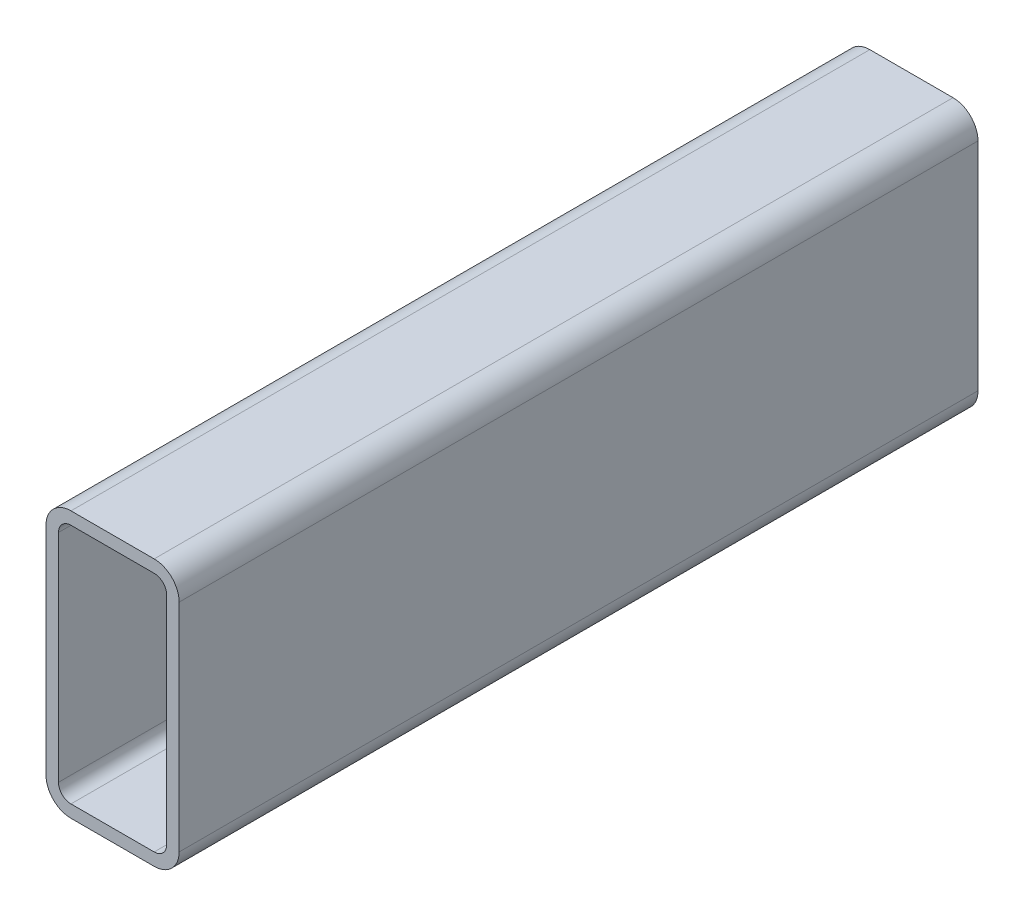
from build123d import *

# Parameters (mm, degrees)
BOSS_EXTRUDE1_DEPTH = 304.8


with BuildPart() as part:
    # Sketch1 → Boss-Extrude1 (new body)
    with BuildSketch(Plane.XY):
        with BuildLine():
            Line((9.525, 101.6), (41.275, 101.6))
            ThreePointArc((41.275, 101.6), (48.010192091, 98.810192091), (50.8, 92.075))
            Line((50.8, 92.075), (50.8, 9.525))
            ThreePointArc((50.8, 9.525), (48.010192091, 2.789807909), (41.275, 0))
            Line((41.275, 0), (9.525, 0))
            ThreePointArc((9.525, 0), (2.789807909, 2.789807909), (0, 9.525))
            Line((0, 9.525), (0, 92.075))
            ThreePointArc((0, 92.075), (2.789807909, 98.810192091), (9.525, 101.6))
        make_face()
        with BuildLine():
            Line((9.525, 96.8375), (41.275, 96.8375))
            ThreePointArc((41.275, 96.8375), (44.642596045, 95.442596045), (46.0375, 92.075))
            Line((46.0375, 92.075), (46.0375, 9.525))
            ThreePointArc((46.0375, 9.525), (44.642596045, 6.157403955), (41.275, 4.7625))
            Line((41.275, 4.7625), (9.525, 4.7625))
            ThreePointArc((9.525, 4.7625), (6.157403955, 6.157403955), (4.7625, 9.525))
            Line((4.7625, 9.525), (4.7625, 92.075))
            ThreePointArc((4.7625, 92.075), (6.157403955, 95.442596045), (9.525, 96.8375))
        make_face(mode=Mode.SUBTRACT)
    extrude(amount=BOSS_EXTRUDE1_DEPTH)


solid = part.part
